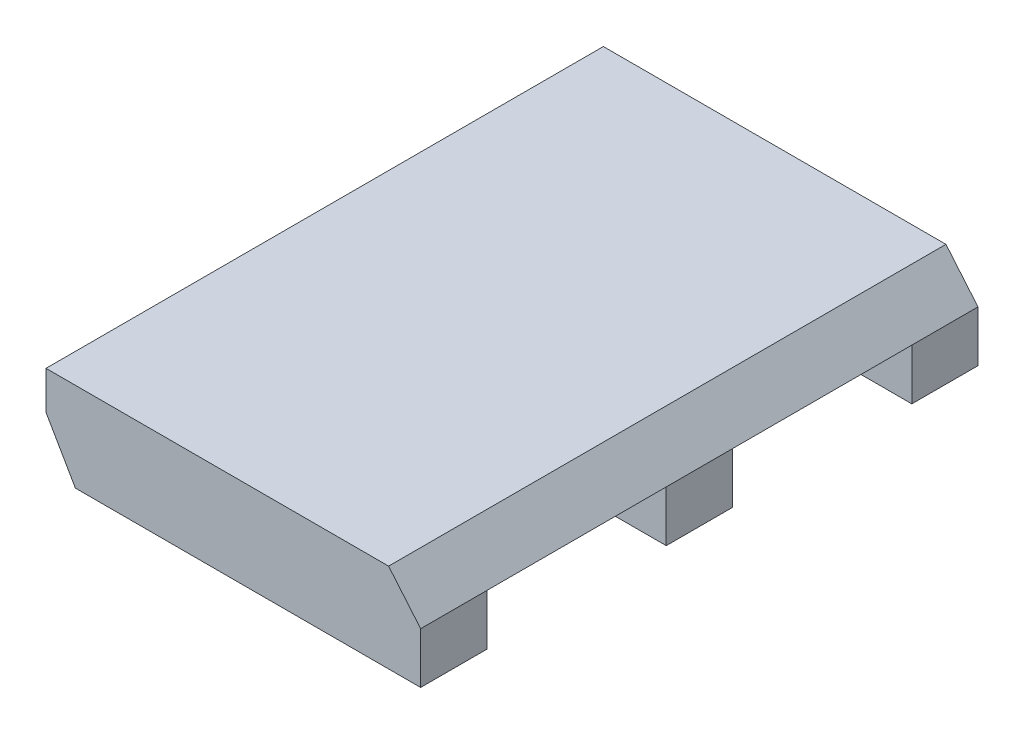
from build123d import *

# Parameters (mm, degrees)
BOSS_EXTRU_1_DEPTH         = 21.9
BOSS_EXTRU_2_DEPTH         = 2.6
R_P_TITION_LIN_AIRE1_COUNT = 3
R_P_TITION_LIN_AIRE1_PITCH = 9.65


with BuildPart() as part:
    # Esquisse1 → Boss.-Extru.1 (new body)
    with BuildSketch(Plane.XY):
        Polygon((13.461350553, 0), (14.72, -1.5), (0, -1.5), (0, 0), align=None)
    extrude(amount=BOSS_EXTRU_1_DEPTH)

    # Esquisse2 → Boss.-Extru.2 (add)
    with BuildSketch(Plane.XY.offset(21.9)):
        Polygon((0, -1.5), (14.72, -1.5), (14.72, -3.5), (1.154700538, -3.5), align=None)
    boss_extru_2 = extrude(amount=-BOSS_EXTRU_2_DEPTH)

    # R_p_tition lin_aire1: Boss.-Extru.2 ×3
    with Locations(*[(0, 0, -i * R_P_TITION_LIN_AIRE1_PITCH) for i in range(1, R_P_TITION_LIN_AIRE1_COUNT)]):
        add(boss_extru_2)


solid = part.part
